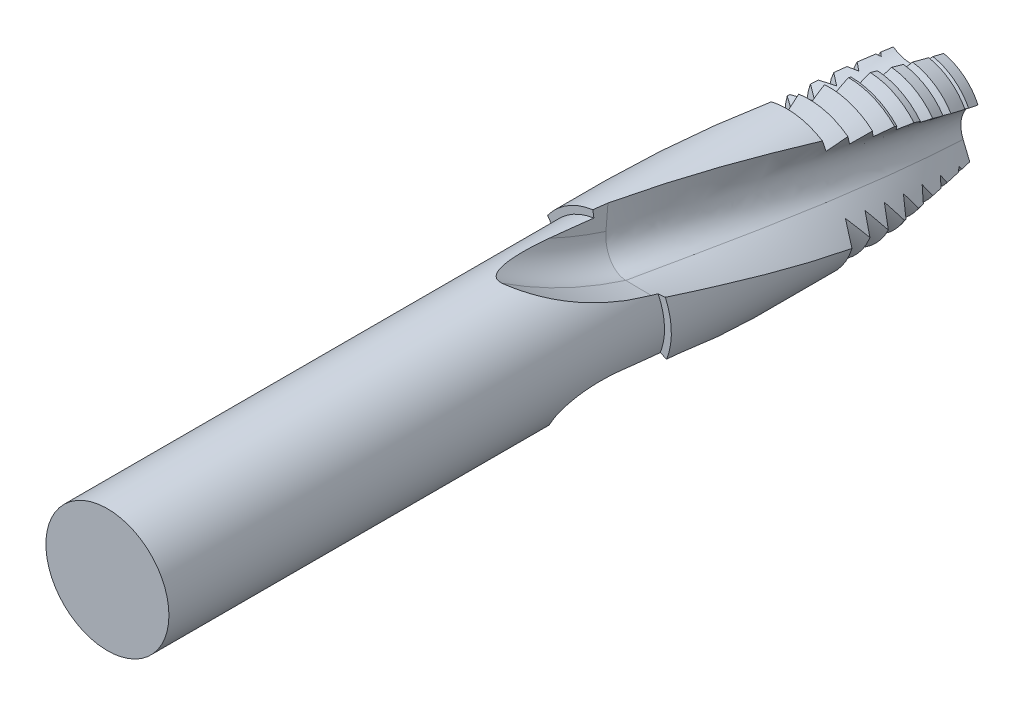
from build123d import *

# Parameters (mm, degrees)
REPDENT_COUNT            = 7
REPDENT_PITCH            = 0.15
TAGH_GOUJURE_PITCH       = 11.72
TAGH_GOUJURE_HEIGHT      = 8
TAGH_GOUJURE_RADIUS      = 0.5
TAGH_GOUJURE_START_ANGLE = 135
TAGH_DEG_ANGLE           = 90
REPGOUJURE_COUNT         = 3


with BuildPart() as part:
    # EsqCorps → CorpsOutil (revolve)
    with BuildSketch(Plane(origin=(0, 0, 0), x_dir=(0, 0, -1), z_dir=(1, 0, 0)), mode=Mode.PRIVATE) as corpsoutil_sk:
        Polygon((0, 0), (0, 0.358938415), (-0.8, 0.5), (-2.416666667, 0.5), (-2.416666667, 0.45), (-6.041666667, 0.45), (-6.041666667, 0), align=None)
    revolve(corpsoutil_sk.sketch.rotate(Axis((0, 0, 2.948442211), (0, 0, -1)), 90), axis=Axis((0, 0, 2.948442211), (0, 0, -1)))

    # EsqDent → TAGH-Dent (revolve, cut)
    with BuildSketch(Plane(origin=(0, 0, 0), x_dir=(0, 0, -1), z_dir=(1, 0, 0)), mode=Mode.PRIVATE) as tagh_dent_sk:
        Polygon((-0.173205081, 0.5), (-0.08660254, 0.35), (0, 0.5), align=None)
    tagh_dent = revolve(tagh_dent_sk.sketch.rotate(Axis((0, 0, 0.610249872), (0, 0, -1)), 90), axis=Axis((0, 0, 0.610249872), (0, 0, -1)), mode=Mode.SUBTRACT)

    # RepDent: TAGH-Dent ×7
    with Locations(*[(0, 0, i * REPDENT_PITCH) for i in range(1, REPDENT_COUNT)]):
        add(tagh_dent, mode=Mode.SUBTRACT)

    # TAGH-Goujure: sweep along a helix
    with BuildLine() as tagh_goujure_path:
        add(Helix(TAGH_GOUJURE_PITCH, TAGH_GOUJURE_HEIGHT, TAGH_GOUJURE_RADIUS, center=(0, 0, 2.426666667), direction=(0, 0, -1), mode=Mode.PRIVATE).rotate(Axis((0, 0, 2.426666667), (0, 0, -1)), TAGH_GOUJURE_START_ANGLE))
    # EsqGoujure-Helice → TAGH-Goujure (sweep, cut)
    with BuildSketch(Plane(origin=(0.353553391, 0.353553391, 2.426666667), x_dir=(-0.9766521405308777, -0.14619759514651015, -0.1574066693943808), z_dir=(0.18307947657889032, -0.18307947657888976, -0.9659005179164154))):
        with BuildLine():
            Line((0.398561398, 0.048080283), (0.398561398, 2.098080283))
            ThreePointArc((0.398561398, 2.098080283), (-1.244606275, 1.447365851), (-1.996746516, -0.151919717))
            Line((-1.996746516, -0.151919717), (0.198561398, -0.151919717))
            ThreePointArc((0.198561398, -0.151919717), (0.339982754, -0.093341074), (0.398561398, 0.048080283))
        make_face()
    tagh_goujure = sweep(path=tagh_goujure_path.line, is_frenet=True, mode=Mode.SUBTRACT)

    # EsqGoujure-Deg → TAGH-Deg (revolve, cut)
    with BuildSketch(Plane(origin=(0.353553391, 0.353553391, 2.426666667), x_dir=(-0.9766521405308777, -0.14619759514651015, -0.1574066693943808), z_dir=(0.18307947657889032, -0.18307947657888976, -0.9659005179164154))):
        with BuildLine():
            Line((0.398561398, 0.048080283), (0.398561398, 2.098080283))
            ThreePointArc((0.398561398, 2.098080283), (-1.244606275, 1.447365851), (-1.996746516, -0.151919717))
            Line((-1.996746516, -0.151919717), (0.198561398, -0.151919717))
            ThreePointArc((0.198561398, -0.151919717), (0.339982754, -0.093341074), (0.398561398, 0.048080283))
        make_face()
    tagh_deg = revolve(axis=Axis((2.968702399, 3.067252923, 2.407987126), (-0.9766521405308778, -0.14619759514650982, -0.15740666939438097)), revolution_arc=TAGH_DEG_ANGLE, mode=Mode.SUBTRACT)

    # RepGoujure: TAGH-Goujure, TAGH-Deg ×3 about axis
    repgoujure_axis = Axis((0, 0, -1.495186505), (0, 0, 1))
    add([tagh_goujure.rotate(repgoujure_axis, i * 360 / REPGOUJURE_COUNT) for i in range(1, REPGOUJURE_COUNT)], mode=Mode.SUBTRACT)
    add([tagh_deg.rotate(repgoujure_axis, i * 360 / REPGOUJURE_COUNT) for i in range(1, REPGOUJURE_COUNT)], mode=Mode.SUBTRACT)


solid = part.part
